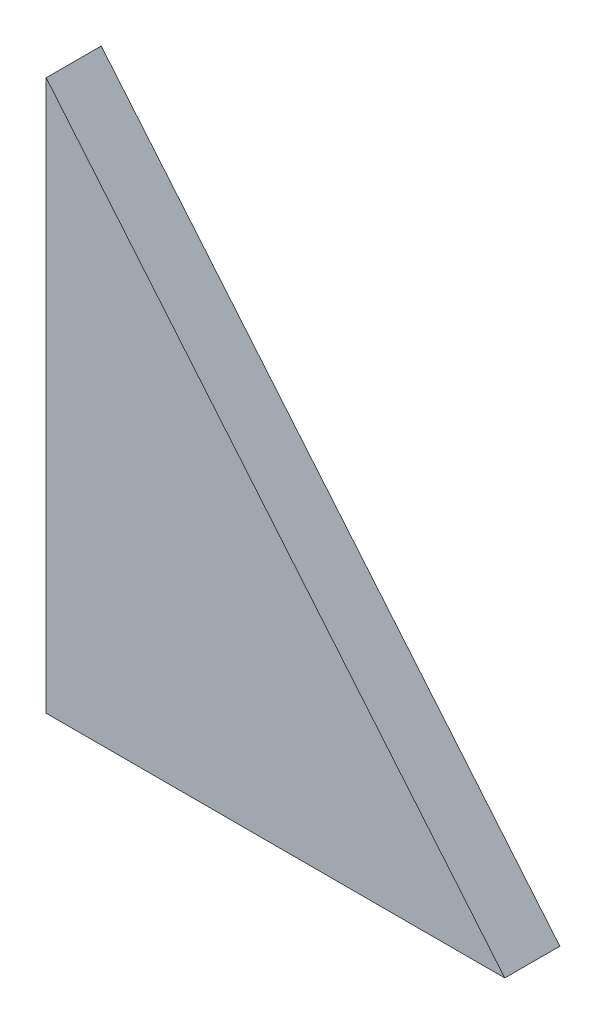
from build123d import *

# Parameters (mm, degrees)
EXTRUDE_1_DEPTH = 6


with BuildPart() as part:
    # Sketch 1 → Extrude 1 (new body)
    with BuildSketch(Plane.XY):
        Polygon((0, 60), (0, 0), (50, 0), align=None)
    extrude(amount=EXTRUDE_1_DEPTH)


solid = part.part
